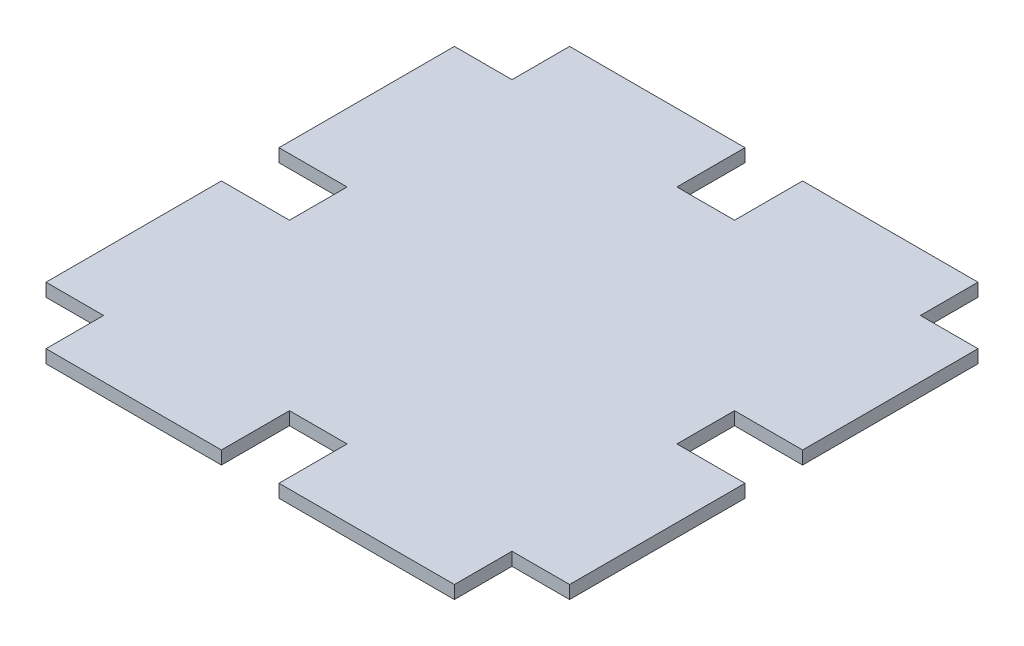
ISO-10303-21;
HEADER;
FILE_DESCRIPTION(('STEP AP214'),'2;1');
FILE_NAME('part.step','',(''),(''),'','','');
FILE_SCHEMA(('AUTOMOTIVE_DESIGN { 1 0 10303 214 1 1 1 1 }'));
ENDSEC;
DATA;
#1=APPLICATION_CONTEXT('core data for automotive mechanical design processes');
#2=APPLICATION_PROTOCOL_DEFINITION('international standard','automotive_design',2000,#1);
#3=PRODUCT_CONTEXT('',#1,'mechanical');
#4=PRODUCT('Part','Part','',(#3));
#5=PRODUCT_RELATED_PRODUCT_CATEGORY('part','',(#4));
#6=PRODUCT_DEFINITION_FORMATION('','',#4);
#7=PRODUCT_DEFINITION_CONTEXT('part definition',#1,'design');
#8=PRODUCT_DEFINITION('design','',#6,#7);
#9=PRODUCT_DEFINITION_SHAPE('','',#8);
#10=(LENGTH_UNIT() NAMED_UNIT(*) SI_UNIT(.MILLI.,.METRE.));
#11=(NAMED_UNIT(*) PLANE_ANGLE_UNIT() SI_UNIT($,.RADIAN.));
#12=(NAMED_UNIT(*) SI_UNIT($,.STERADIAN.) SOLID_ANGLE_UNIT());
#13=UNCERTAINTY_MEASURE_WITH_UNIT(LENGTH_MEASURE(1.E-05),#10,'distance_accuracy_value','');
#14=(GEOMETRIC_REPRESENTATION_CONTEXT(3) GLOBAL_UNCERTAINTY_ASSIGNED_CONTEXT((#13)) GLOBAL_UNIT_ASSIGNED_CONTEXT((#10,
#11,#12)) REPRESENTATION_CONTEXT('',''));
#15=CARTESIAN_POINT('',(0.,0.,0.));
#16=DIRECTION('',(0.,0.,1.));
#17=DIRECTION('',(1.,0.,0.));
#18=AXIS2_PLACEMENT_3D('',#15,#16,#17);
#19=CARTESIAN_POINT('',(0.,6.35,127.));
#20=DIRECTION('',(0.,0.,-1.));
#21=DIRECTION('',(-1.,0.,0.));
#22=AXIS2_PLACEMENT_3D('',#19,#20,#21);
#23=PLANE('',#22);
#24=DIRECTION('',(1.,0.,0.));
#25=VECTOR('',#24,1.);
#26=CARTESIAN_POINT('',(0.,0.,127.));
#27=LINE('',#26,#25);
#28=CARTESIAN_POINT('',(13.97,0.,127.));
#29=VERTEX_POINT('',#28);
#30=CARTESIAN_POINT('',(99.06,0.,127.));
#31=VERTEX_POINT('',#30);
#32=EDGE_CURVE('E253',#29,#31,#27,.T.);
#33=ORIENTED_EDGE('',*,*,#32,.T.);
#34=DIRECTION('',(0.,-1.,0.));
#35=VECTOR('',#34,1.);
#36=CARTESIAN_POINT('',(99.06,6.35,127.));
#37=LINE('',#36,#35);
#38=CARTESIAN_POINT('',(99.06,6.35,127.));
#39=VERTEX_POINT('',#38);
#40=EDGE_CURVE('E11',#39,#31,#37,.T.);
#41=ORIENTED_EDGE('',*,*,#40,.F.);
#42=DIRECTION('',(1.,0.,0.));
#43=VECTOR('',#42,1.);
#44=CARTESIAN_POINT('',(0.,6.35,127.));
#45=LINE('',#44,#43);
#46=CARTESIAN_POINT('',(13.97,6.35,127.));
#47=VERTEX_POINT('',#46);
#48=EDGE_CURVE('E323',#47,#39,#45,.T.);
#49=ORIENTED_EDGE('',*,*,#48,.F.);
#50=DIRECTION('',(0.,-1.,0.));
#51=VECTOR('',#50,1.);
#52=CARTESIAN_POINT('',(13.97,6.35,127.));
#53=LINE('',#52,#51);
#54=EDGE_CURVE('E51',#47,#29,#53,.T.);
#55=ORIENTED_EDGE('',*,*,#54,.T.);
#56=EDGE_LOOP('',(#33,#41,#49,#55));
#57=FACE_BOUND('',#56,.T.);
#58=ADVANCED_FACE('F34',(#57),#23,.F.);
#59=CARTESIAN_POINT('',(99.06,6.35,0.));
#60=DIRECTION('',(-1.,0.,0.));
#61=DIRECTION('',(0.,0.,1.));
#62=AXIS2_PLACEMENT_3D('',#59,#60,#61);
#63=PLANE('',#62);
#64=DIRECTION('',(0.,0.,-1.));
#65=VECTOR('',#64,1.);
#66=CARTESIAN_POINT('',(99.06,0.,0.));
#67=LINE('',#66,#65);
#68=CARTESIAN_POINT('',(99.06,0.,99.0599999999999));
#69=VERTEX_POINT('',#68);
#70=EDGE_CURVE('E255',#31,#69,#67,.T.);
#71=ORIENTED_EDGE('',*,*,#70,.T.);
#72=DIRECTION('',(0.,-1.,0.));
#73=VECTOR('',#72,1.);
#74=CARTESIAN_POINT('',(99.06,6.35,99.0599999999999));
#75=LINE('',#74,#73);
#76=CARTESIAN_POINT('',(99.06,6.35,99.0599999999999));
#77=VERTEX_POINT('',#76);
#78=EDGE_CURVE('E43',#77,#69,#75,.T.);
#79=ORIENTED_EDGE('',*,*,#78,.F.);
#80=DIRECTION('',(0.,0.,-1.));
#81=VECTOR('',#80,1.);
#82=CARTESIAN_POINT('',(99.06,6.35,0.));
#83=LINE('',#82,#81);
#84=EDGE_CURVE('E150',#39,#77,#83,.T.);
#85=ORIENTED_EDGE('',*,*,#84,.F.);
#86=ORIENTED_EDGE('',*,*,#40,.T.);
#87=EDGE_LOOP('',(#71,#79,#85,#86));
#88=FACE_BOUND('',#87,.T.);
#89=ADVANCED_FACE('F36',(#88),#63,.F.);
#90=CARTESIAN_POINT('',(0.,6.35,99.06));
#91=DIRECTION('',(0.,0.,1.));
#92=DIRECTION('',(1.,0.,0.));
#93=AXIS2_PLACEMENT_3D('',#90,#91,#92);
#94=PLANE('',#93);
#95=DIRECTION('',(-1.,0.,0.));
#96=VECTOR('',#95,1.);
#97=CARTESIAN_POINT('',(0.,0.,99.06));
#98=LINE('',#97,#96);
#99=CARTESIAN_POINT('',(127.,0.,99.0599999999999));
#100=VERTEX_POINT('',#99);
#101=EDGE_CURVE('E259',#100,#69,#98,.T.);
#102=ORIENTED_EDGE('',*,*,#101,.F.);
#103=DIRECTION('',(0.,-1.,0.));
#104=VECTOR('',#103,1.);
#105=CARTESIAN_POINT('',(127.,6.35,99.0599999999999));
#106=LINE('',#105,#104);
#107=CARTESIAN_POINT('',(127.,6.35,99.0599999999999));
#108=VERTEX_POINT('',#107);
#109=EDGE_CURVE('E372',#108,#100,#106,.T.);
#110=ORIENTED_EDGE('',*,*,#109,.F.);
#111=DIRECTION('',(-1.,0.,0.));
#112=VECTOR('',#111,1.);
#113=CARTESIAN_POINT('',(0.,6.35,99.06));
#114=LINE('',#113,#112);
#115=EDGE_CURVE('E378',#108,#77,#114,.T.);
#116=ORIENTED_EDGE('',*,*,#115,.T.);
#117=ORIENTED_EDGE('',*,*,#78,.T.);
#118=EDGE_LOOP('',(#102,#110,#116,#117));
#119=FACE_BOUND('',#118,.T.);
#120=ADVANCED_FACE('F376',(#119),#94,.T.);
#121=CARTESIAN_POINT('',(127.,6.35,0.));
#122=DIRECTION('',(1.,0.,0.));
#123=DIRECTION('',(0.,0.,-1.));
#124=AXIS2_PLACEMENT_3D('',#121,#122,#123);
#125=PLANE('',#124);
#126=DIRECTION('',(0.,0.,1.));
#127=VECTOR('',#126,1.);
#128=CARTESIAN_POINT('',(127.,0.,0.));
#129=LINE('',#128,#127);
#130=CARTESIAN_POINT('',(127.,0.,13.9699999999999));
#131=VERTEX_POINT('',#130);
#132=EDGE_CURVE('E262',#131,#100,#129,.T.);
#133=ORIENTED_EDGE('',*,*,#132,.F.);
#134=DIRECTION('',(0.,-1.,0.));
#135=VECTOR('',#134,1.);
#136=CARTESIAN_POINT('',(127.,6.35,13.9699999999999));
#137=LINE('',#136,#135);
#138=CARTESIAN_POINT('',(127.,6.35,13.9699999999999));
#139=VERTEX_POINT('',#138);
#140=EDGE_CURVE('E370',#139,#131,#137,.T.);
#141=ORIENTED_EDGE('',*,*,#140,.F.);
#142=DIRECTION('',(0.,0.,1.));
#143=VECTOR('',#142,1.);
#144=CARTESIAN_POINT('',(127.,6.35,0.));
#145=LINE('',#144,#143);
#146=EDGE_CURVE('E389',#139,#108,#145,.T.);
#147=ORIENTED_EDGE('',*,*,#146,.T.);
#148=ORIENTED_EDGE('',*,*,#109,.T.);
#149=EDGE_LOOP('',(#133,#141,#147,#148));
#150=FACE_BOUND('',#149,.T.);
#151=ADVANCED_FACE('F385',(#150),#125,.T.);
#152=CARTESIAN_POINT('',(0.,6.35,13.9699999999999));
#153=DIRECTION('',(0.,0.,1.));
#154=DIRECTION('',(1.,0.,0.));
#155=AXIS2_PLACEMENT_3D('',#152,#153,#154);
#156=PLANE('',#155);
#157=DIRECTION('',(-1.,0.,0.));
#158=VECTOR('',#157,1.);
#159=CARTESIAN_POINT('',(0.,0.,13.9699999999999));
#160=LINE('',#159,#158);
#161=CARTESIAN_POINT('',(93.98,0.,13.9699999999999));
#162=VERTEX_POINT('',#161);
#163=EDGE_CURVE('E265',#131,#162,#160,.T.);
#164=ORIENTED_EDGE('',*,*,#163,.T.);
#165=DIRECTION('',(0.,-1.,0.));
#166=VECTOR('',#165,1.);
#167=CARTESIAN_POINT('',(93.98,6.35,13.9699999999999));
#168=LINE('',#167,#166);
#169=CARTESIAN_POINT('',(93.98,6.35,13.9699999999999));
#170=VERTEX_POINT('',#169);
#171=EDGE_CURVE('E368',#170,#162,#168,.T.);
#172=ORIENTED_EDGE('',*,*,#171,.F.);
#173=DIRECTION('',(-1.,0.,0.));
#174=VECTOR('',#173,1.);
#175=CARTESIAN_POINT('',(0.,6.35,13.9699999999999));
#176=LINE('',#175,#174);
#177=EDGE_CURVE('E391',#139,#170,#176,.T.);
#178=ORIENTED_EDGE('',*,*,#177,.F.);
#179=ORIENTED_EDGE('',*,*,#140,.T.);
#180=EDGE_LOOP('',(#164,#172,#178,#179));
#181=FACE_BOUND('',#180,.T.);
#182=ADVANCED_FACE('F551',(#181),#156,.F.);
#183=CARTESIAN_POINT('',(93.98,6.35,0.));
#184=DIRECTION('',(1.,0.,0.));
#185=DIRECTION('',(0.,0.,-1.));
#186=AXIS2_PLACEMENT_3D('',#183,#184,#185);
#187=PLANE('',#186);
#188=DIRECTION('',(0.,0.,1.));
#189=VECTOR('',#188,1.);
#190=CARTESIAN_POINT('',(93.98,0.,0.));
#191=LINE('',#190,#189);
#192=CARTESIAN_POINT('',(93.98,0.,-13.9700000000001));
#193=VERTEX_POINT('',#192);
#194=EDGE_CURVE('E269',#193,#162,#191,.T.);
#195=ORIENTED_EDGE('',*,*,#194,.F.);
#196=DIRECTION('',(0.,-1.,0.));
#197=VECTOR('',#196,1.);
#198=CARTESIAN_POINT('',(93.98,6.35,-13.9700000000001));
#199=LINE('',#198,#197);
#200=CARTESIAN_POINT('',(93.98,6.35,-13.9700000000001));
#201=VERTEX_POINT('',#200);
#202=EDGE_CURVE('E366',#201,#193,#199,.T.);
#203=ORIENTED_EDGE('',*,*,#202,.F.);
#204=DIRECTION('',(0.,0.,1.));
#205=VECTOR('',#204,1.);
#206=CARTESIAN_POINT('',(93.98,6.35,0.));
#207=LINE('',#206,#205);
#208=EDGE_CURVE('E398',#201,#170,#207,.T.);
#209=ORIENTED_EDGE('',*,*,#208,.T.);
#210=ORIENTED_EDGE('',*,*,#171,.T.);
#211=EDGE_LOOP('',(#195,#203,#209,#210));
#212=FACE_BOUND('',#211,.T.);
#213=ADVANCED_FACE('F548',(#212),#187,.T.);
#214=CARTESIAN_POINT('',(0.,6.35,-13.97));
#215=DIRECTION('',(0.,0.,1.));
#216=DIRECTION('',(1.,0.,0.));
#217=AXIS2_PLACEMENT_3D('',#214,#215,#216);
#218=PLANE('',#217);
#219=DIRECTION('',(-1.,0.,0.));
#220=VECTOR('',#219,1.);
#221=CARTESIAN_POINT('',(0.,0.,-13.97));
#222=LINE('',#221,#220);
#223=CARTESIAN_POINT('',(127.,0.,-13.9700000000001));
#224=VERTEX_POINT('',#223);
#225=EDGE_CURVE('E272',#224,#193,#222,.T.);
#226=ORIENTED_EDGE('',*,*,#225,.F.);
#227=DIRECTION('',(0.,-1.,0.));
#228=VECTOR('',#227,1.);
#229=CARTESIAN_POINT('',(127.,6.35,-13.9700000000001));
#230=LINE('',#229,#228);
#231=CARTESIAN_POINT('',(127.,6.35,-13.9700000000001));
#232=VERTEX_POINT('',#231);
#233=EDGE_CURVE('E364',#232,#224,#230,.T.);
#234=ORIENTED_EDGE('',*,*,#233,.F.);
#235=DIRECTION('',(-1.,0.,0.));
#236=VECTOR('',#235,1.);
#237=CARTESIAN_POINT('',(0.,6.35,-13.97));
#238=LINE('',#237,#236);
#239=EDGE_CURVE('E401',#232,#201,#238,.T.);
#240=ORIENTED_EDGE('',*,*,#239,.T.);
#241=ORIENTED_EDGE('',*,*,#202,.T.);
#242=EDGE_LOOP('',(#226,#234,#240,#241));
#243=FACE_BOUND('',#242,.T.);
#244=ADVANCED_FACE('F544',(#243),#218,.T.);
#245=CARTESIAN_POINT('',(127.,0.,-99.06));
#246=VERTEX_POINT('',#245);
#247=EDGE_CURVE('E266',#246,#224,#129,.T.);
#248=ORIENTED_EDGE('',*,*,#247,.F.);
#249=DIRECTION('',(0.,-1.,0.));
#250=VECTOR('',#249,1.);
#251=CARTESIAN_POINT('',(127.,6.35,-99.06));
#252=LINE('',#251,#250);
#253=CARTESIAN_POINT('',(127.,6.35,-99.06));
#254=VERTEX_POINT('',#253);
#255=EDGE_CURVE('E362',#254,#246,#252,.T.);
#256=ORIENTED_EDGE('',*,*,#255,.F.);
#257=EDGE_CURVE('E393',#254,#232,#145,.T.);
#258=ORIENTED_EDGE('',*,*,#257,.T.);
#259=ORIENTED_EDGE('',*,*,#233,.T.);
#260=EDGE_LOOP('',(#248,#256,#258,#259));
#261=FACE_BOUND('',#260,.T.);
#262=ADVANCED_FACE('F540',(#261),#125,.T.);
#263=CARTESIAN_POINT('',(0.,6.35,-99.0600000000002));
#264=DIRECTION('',(0.,0.,1.));
#265=DIRECTION('',(1.,0.,0.));
#266=AXIS2_PLACEMENT_3D('',#263,#264,#265);
#267=PLANE('',#266);
#268=DIRECTION('',(-1.,0.,0.));
#269=VECTOR('',#268,1.);
#270=CARTESIAN_POINT('',(0.,0.,-99.0600000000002));
#271=LINE('',#270,#269);
#272=CARTESIAN_POINT('',(99.06,0.,-99.0600000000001));
#273=VERTEX_POINT('',#272);
#274=EDGE_CURVE('E275',#246,#273,#271,.T.);
#275=ORIENTED_EDGE('',*,*,#274,.T.);
#276=DIRECTION('',(0.,-1.,0.));
#277=VECTOR('',#276,1.);
#278=CARTESIAN_POINT('',(99.06,6.35,-99.0600000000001));
#279=LINE('',#278,#277);
#280=CARTESIAN_POINT('',(99.06,6.35,-99.0600000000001));
#281=VERTEX_POINT('',#280);
#282=EDGE_CURVE('E360',#281,#273,#279,.T.);
#283=ORIENTED_EDGE('',*,*,#282,.F.);
#284=DIRECTION('',(-1.,0.,0.));
#285=VECTOR('',#284,1.);
#286=CARTESIAN_POINT('',(0.,6.35,-99.0600000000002));
#287=LINE('',#286,#285);
#288=EDGE_CURVE('E404',#254,#281,#287,.T.);
#289=ORIENTED_EDGE('',*,*,#288,.F.);
#290=ORIENTED_EDGE('',*,*,#255,.T.);
#291=EDGE_LOOP('',(#275,#283,#289,#290));
#292=FACE_BOUND('',#291,.T.);
#293=ADVANCED_FACE('F536',(#292),#267,.F.);
#294=CARTESIAN_POINT('',(99.06,6.35,0.));
#295=DIRECTION('',(1.,0.,0.));
#296=DIRECTION('',(0.,0.,-1.));
#297=AXIS2_PLACEMENT_3D('',#294,#295,#296);
#298=PLANE('',#297);
#299=DIRECTION('',(0.,0.,1.));
#300=VECTOR('',#299,1.);
#301=CARTESIAN_POINT('',(99.06,0.,0.));
#302=LINE('',#301,#300);
#303=CARTESIAN_POINT('',(99.06,0.,-127.));
#304=VERTEX_POINT('',#303);
#305=EDGE_CURVE('E278',#304,#273,#302,.T.);
#306=ORIENTED_EDGE('',*,*,#305,.F.);
#307=DIRECTION('',(0.,-1.,0.));
#308=VECTOR('',#307,1.);
#309=CARTESIAN_POINT('',(99.06,6.35,-127.));
#310=LINE('',#309,#308);
#311=CARTESIAN_POINT('',(99.06,6.35,-127.));
#312=VERTEX_POINT('',#311);
#313=EDGE_CURVE('E358',#312,#304,#310,.T.);
#314=ORIENTED_EDGE('',*,*,#313,.F.);
#315=DIRECTION('',(0.,0.,1.));
#316=VECTOR('',#315,1.);
#317=CARTESIAN_POINT('',(99.06,6.35,0.));
#318=LINE('',#317,#316);
#319=EDGE_CURVE('E406',#312,#281,#318,.T.);
#320=ORIENTED_EDGE('',*,*,#319,.T.);
#321=ORIENTED_EDGE('',*,*,#282,.T.);
#322=EDGE_LOOP('',(#306,#314,#320,#321));
#323=FACE_BOUND('',#322,.T.);
#324=ADVANCED_FACE('F531',(#323),#298,.T.);
#325=CARTESIAN_POINT('',(0.,6.35,-127.));
#326=DIRECTION('',(0.,0.,-1.));
#327=DIRECTION('',(-1.,0.,0.));
#328=AXIS2_PLACEMENT_3D('',#325,#326,#327);
#329=PLANE('',#328);
#330=DIRECTION('',(1.,0.,0.));
#331=VECTOR('',#330,1.);
#332=CARTESIAN_POINT('',(0.,0.,-127.));
#333=LINE('',#332,#331);
#334=CARTESIAN_POINT('',(13.97,0.,-127.));
#335=VERTEX_POINT('',#334);
#336=EDGE_CURVE('E281',#335,#304,#333,.T.);
#337=ORIENTED_EDGE('',*,*,#336,.F.);
#338=DIRECTION('',(0.,-1.,0.));
#339=VECTOR('',#338,1.);
#340=CARTESIAN_POINT('',(13.97,6.35,-127.));
#341=LINE('',#340,#339);
#342=CARTESIAN_POINT('',(13.97,6.35,-127.));
#343=VERTEX_POINT('',#342);
#344=EDGE_CURVE('E356',#343,#335,#341,.T.);
#345=ORIENTED_EDGE('',*,*,#344,.F.);
#346=DIRECTION('',(1.,0.,0.));
#347=VECTOR('',#346,1.);
#348=CARTESIAN_POINT('',(0.,6.35,-127.));
#349=LINE('',#348,#347);
#350=EDGE_CURVE('E409',#343,#312,#349,.T.);
#351=ORIENTED_EDGE('',*,*,#350,.T.);
#352=ORIENTED_EDGE('',*,*,#313,.T.);
#353=EDGE_LOOP('',(#337,#345,#351,#352));
#354=FACE_BOUND('',#353,.T.);
#355=ADVANCED_FACE('F525',(#354),#329,.T.);
#356=CARTESIAN_POINT('',(13.97,6.35,0.));
#357=DIRECTION('',(1.,0.,0.));
#358=DIRECTION('',(0.,0.,-1.));
#359=AXIS2_PLACEMENT_3D('',#356,#357,#358);
#360=PLANE('',#359);
#361=DIRECTION('',(0.,0.,1.));
#362=VECTOR('',#361,1.);
#363=CARTESIAN_POINT('',(13.97,0.,0.));
#364=LINE('',#363,#362);
#365=CARTESIAN_POINT('',(13.97,0.,-93.9800000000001));
#366=VERTEX_POINT('',#365);
#367=EDGE_CURVE('E284',#335,#366,#364,.T.);
#368=ORIENTED_EDGE('',*,*,#367,.T.);
#369=DIRECTION('',(0.,-1.,0.));
#370=VECTOR('',#369,1.);
#371=CARTESIAN_POINT('',(13.97,6.35,-93.9800000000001));
#372=LINE('',#371,#370);
#373=CARTESIAN_POINT('',(13.97,6.35,-93.9800000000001));
#374=VERTEX_POINT('',#373);
#375=EDGE_CURVE('E354',#374,#366,#372,.T.);
#376=ORIENTED_EDGE('',*,*,#375,.F.);
#377=DIRECTION('',(0.,0.,1.));
#378=VECTOR('',#377,1.);
#379=CARTESIAN_POINT('',(13.97,6.35,0.));
#380=LINE('',#379,#378);
#381=EDGE_CURVE('E412',#343,#374,#380,.T.);
#382=ORIENTED_EDGE('',*,*,#381,.F.);
#383=ORIENTED_EDGE('',*,*,#344,.T.);
#384=EDGE_LOOP('',(#368,#376,#382,#383));
#385=FACE_BOUND('',#384,.T.);
#386=ADVANCED_FACE('F522',(#385),#360,.F.);
#387=CARTESIAN_POINT('',(0.,6.35,-93.9800000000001));
#388=DIRECTION('',(0.,0.,-1.));
#389=DIRECTION('',(-1.,0.,0.));
#390=AXIS2_PLACEMENT_3D('',#387,#388,#389);
#391=PLANE('',#390);
#392=DIRECTION('',(1.,0.,0.));
#393=VECTOR('',#392,1.);
#394=CARTESIAN_POINT('',(0.,0.,-93.9800000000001));
#395=LINE('',#394,#393);
#396=CARTESIAN_POINT('',(-13.97,0.,-93.9800000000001));
#397=VERTEX_POINT('',#396);
#398=EDGE_CURVE('E288',#397,#366,#395,.T.);
#399=ORIENTED_EDGE('',*,*,#398,.F.);
#400=DIRECTION('',(0.,-1.,0.));
#401=VECTOR('',#400,1.);
#402=CARTESIAN_POINT('',(-13.97,6.35,-93.9800000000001));
#403=LINE('',#402,#401);
#404=CARTESIAN_POINT('',(-13.97,6.35,-93.9800000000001));
#405=VERTEX_POINT('',#404);
#406=EDGE_CURVE('E352',#405,#397,#403,.T.);
#407=ORIENTED_EDGE('',*,*,#406,.F.);
#408=DIRECTION('',(1.,0.,0.));
#409=VECTOR('',#408,1.);
#410=CARTESIAN_POINT('',(0.,6.35,-93.9800000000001));
#411=LINE('',#410,#409);
#412=EDGE_CURVE('E415',#405,#374,#411,.T.);
#413=ORIENTED_EDGE('',*,*,#412,.T.);
#414=ORIENTED_EDGE('',*,*,#375,.T.);
#415=EDGE_LOOP('',(#399,#407,#413,#414));
#416=FACE_BOUND('',#415,.T.);
#417=ADVANCED_FACE('F517',(#416),#391,.T.);
#418=CARTESIAN_POINT('',(-13.97,6.35,0.));
#419=DIRECTION('',(1.,0.,0.));
#420=DIRECTION('',(0.,0.,-1.));
#421=AXIS2_PLACEMENT_3D('',#418,#419,#420);
#422=PLANE('',#421);
#423=DIRECTION('',(0.,0.,1.));
#424=VECTOR('',#423,1.);
#425=CARTESIAN_POINT('',(-13.97,0.,0.));
#426=LINE('',#425,#424);
#427=CARTESIAN_POINT('',(-13.97,0.,-127.));
#428=VERTEX_POINT('',#427);
#429=EDGE_CURVE('E291',#428,#397,#426,.T.);
#430=ORIENTED_EDGE('',*,*,#429,.F.);
#431=DIRECTION('',(0.,-1.,0.));
#432=VECTOR('',#431,1.);
#433=CARTESIAN_POINT('',(-13.97,6.35,-127.));
#434=LINE('',#433,#432);
#435=CARTESIAN_POINT('',(-13.97,6.35,-127.));
#436=VERTEX_POINT('',#435);
#437=EDGE_CURVE('E350',#436,#428,#434,.T.);
#438=ORIENTED_EDGE('',*,*,#437,.F.);
#439=DIRECTION('',(0.,0.,1.));
#440=VECTOR('',#439,1.);
#441=CARTESIAN_POINT('',(-13.97,6.35,0.));
#442=LINE('',#441,#440);
#443=EDGE_CURVE('E418',#436,#405,#442,.T.);
#444=ORIENTED_EDGE('',*,*,#443,.T.);
#445=ORIENTED_EDGE('',*,*,#406,.T.);
#446=EDGE_LOOP('',(#430,#438,#444,#445));
#447=FACE_BOUND('',#446,.T.);
#448=ADVANCED_FACE('F512',(#447),#422,.T.);
#449=CARTESIAN_POINT('',(-99.06,0.,-127.));
#450=VERTEX_POINT('',#449);
#451=EDGE_CURVE('E285',#450,#428,#333,.T.);
#452=ORIENTED_EDGE('',*,*,#451,.F.);
#453=DIRECTION('',(0.,-1.,0.));
#454=VECTOR('',#453,1.);
#455=CARTESIAN_POINT('',(-99.06,6.35,-127.));
#456=LINE('',#455,#454);
#457=CARTESIAN_POINT('',(-99.06,6.35,-127.));
#458=VERTEX_POINT('',#457);
#459=EDGE_CURVE('E348',#458,#450,#456,.T.);
#460=ORIENTED_EDGE('',*,*,#459,.F.);
#461=EDGE_CURVE('E413',#458,#436,#349,.T.);
#462=ORIENTED_EDGE('',*,*,#461,.T.);
#463=ORIENTED_EDGE('',*,*,#437,.T.);
#464=EDGE_LOOP('',(#452,#460,#462,#463));
#465=FACE_BOUND('',#464,.T.);
#466=ADVANCED_FACE('F505',(#465),#329,.T.);
#467=CARTESIAN_POINT('',(-99.06,6.35,0.));
#468=DIRECTION('',(1.,0.,0.));
#469=DIRECTION('',(0.,0.,-1.));
#470=AXIS2_PLACEMENT_3D('',#467,#468,#469);
#471=PLANE('',#470);
#472=DIRECTION('',(0.,0.,1.));
#473=VECTOR('',#472,1.);
#474=CARTESIAN_POINT('',(-99.06,0.,0.));
#475=LINE('',#474,#473);
#476=CARTESIAN_POINT('',(-99.06,0.,-99.06));
#477=VERTEX_POINT('',#476);
#478=EDGE_CURVE('E294',#450,#477,#475,.T.);
#479=ORIENTED_EDGE('',*,*,#478,.T.);
#480=DIRECTION('',(0.,-1.,0.));
#481=VECTOR('',#480,1.);
#482=CARTESIAN_POINT('',(-99.06,6.35,-99.06));
#483=LINE('',#482,#481);
#484=CARTESIAN_POINT('',(-99.06,6.35,-99.06));
#485=VERTEX_POINT('',#484);
#486=EDGE_CURVE('E346',#485,#477,#483,.T.);
#487=ORIENTED_EDGE('',*,*,#486,.F.);
#488=DIRECTION('',(0.,0.,1.));
#489=VECTOR('',#488,1.);
#490=CARTESIAN_POINT('',(-99.06,6.35,0.));
#491=LINE('',#490,#489);
#492=EDGE_CURVE('E421',#458,#485,#491,.T.);
#493=ORIENTED_EDGE('',*,*,#492,.F.);
#494=ORIENTED_EDGE('',*,*,#459,.T.);
#495=EDGE_LOOP('',(#479,#487,#493,#494));
#496=FACE_BOUND('',#495,.T.);
#497=ADVANCED_FACE('F552',(#496),#471,.F.);
#498=CARTESIAN_POINT('',(0.,6.35,-99.06));
#499=DIRECTION('',(0.,0.,-1.));
#500=DIRECTION('',(-1.,0.,0.));
#501=AXIS2_PLACEMENT_3D('',#498,#499,#500);
#502=PLANE('',#501);
#503=DIRECTION('',(1.,0.,0.));
#504=VECTOR('',#503,1.);
#505=CARTESIAN_POINT('',(0.,0.,-99.06));
#506=LINE('',#505,#504);
#507=CARTESIAN_POINT('',(-127.,0.,-99.06));
#508=VERTEX_POINT('',#507);
#509=EDGE_CURVE('E297',#508,#477,#506,.T.);
#510=ORIENTED_EDGE('',*,*,#509,.F.);
#511=DIRECTION('',(0.,-1.,0.));
#512=VECTOR('',#511,1.);
#513=CARTESIAN_POINT('',(-127.,6.35,-99.06));
#514=LINE('',#513,#512);
#515=CARTESIAN_POINT('',(-127.,6.35,-99.06));
#516=VERTEX_POINT('',#515);
#517=EDGE_CURVE('E344',#516,#508,#514,.T.);
#518=ORIENTED_EDGE('',*,*,#517,.F.);
#519=DIRECTION('',(1.,0.,0.));
#520=VECTOR('',#519,1.);
#521=CARTESIAN_POINT('',(0.,6.35,-99.06));
#522=LINE('',#521,#520);
#523=EDGE_CURVE('E423',#516,#485,#522,.T.);
#524=ORIENTED_EDGE('',*,*,#523,.T.);
#525=ORIENTED_EDGE('',*,*,#486,.T.);
#526=EDGE_LOOP('',(#510,#518,#524,#525));
#527=FACE_BOUND('',#526,.T.);
#528=ADVANCED_FACE('F498',(#527),#502,.T.);
#529=CARTESIAN_POINT('',(-127.,6.35,0.));
#530=DIRECTION('',(1.,0.,0.));
#531=DIRECTION('',(0.,0.,-1.));
#532=AXIS2_PLACEMENT_3D('',#529,#530,#531);
#533=PLANE('',#532);
#534=DIRECTION('',(0.,0.,1.));
#535=VECTOR('',#534,1.);
#536=CARTESIAN_POINT('',(-127.,0.,0.));
#537=LINE('',#536,#535);
#538=CARTESIAN_POINT('',(-127.,0.,-13.9700000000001));
#539=VERTEX_POINT('',#538);
#540=EDGE_CURVE('E300',#508,#539,#537,.T.);
#541=ORIENTED_EDGE('',*,*,#540,.T.);
#542=DIRECTION('',(0.,-1.,0.));
#543=VECTOR('',#542,1.);
#544=CARTESIAN_POINT('',(-127.,6.35,-13.9700000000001));
#545=LINE('',#544,#543);
#546=CARTESIAN_POINT('',(-127.,6.35,-13.9700000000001));
#547=VERTEX_POINT('',#546);
#548=EDGE_CURVE('E341',#547,#539,#545,.T.);
#549=ORIENTED_EDGE('',*,*,#548,.F.);
#550=DIRECTION('',(0.,0.,1.));
#551=VECTOR('',#550,1.);
#552=CARTESIAN_POINT('',(-127.,6.35,0.));
#553=LINE('',#552,#551);
#554=EDGE_CURVE('E426',#516,#547,#553,.T.);
#555=ORIENTED_EDGE('',*,*,#554,.F.);
#556=ORIENTED_EDGE('',*,*,#517,.T.);
#557=EDGE_LOOP('',(#541,#549,#555,#556));
#558=FACE_BOUND('',#557,.T.);
#559=ADVANCED_FACE('F495',(#558),#533,.F.);
#560=CARTESIAN_POINT('',(0.,6.35,-13.9700000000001));
#561=DIRECTION('',(0.,0.,-1.));
#562=DIRECTION('',(-1.,0.,0.));
#563=AXIS2_PLACEMENT_3D('',#560,#561,#562);
#564=PLANE('',#563);
#565=DIRECTION('',(1.,0.,0.));
#566=VECTOR('',#565,1.);
#567=CARTESIAN_POINT('',(0.,0.,-13.9700000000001));
#568=LINE('',#567,#566);
#569=CARTESIAN_POINT('',(-93.98,0.,-13.9700000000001));
#570=VERTEX_POINT('',#569);
#571=EDGE_CURVE('E302',#539,#570,#568,.T.);
#572=ORIENTED_EDGE('',*,*,#571,.T.);
#573=DIRECTION('',(0.,-1.,0.));
#574=VECTOR('',#573,1.);
#575=CARTESIAN_POINT('',(-93.98,6.35,-13.9700000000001));
#576=LINE('',#575,#574);
#577=CARTESIAN_POINT('',(-93.98,6.35,-13.9700000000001));
#578=VERTEX_POINT('',#577);
#579=EDGE_CURVE('E338',#578,#570,#576,.T.);
#580=ORIENTED_EDGE('',*,*,#579,.F.);
#581=DIRECTION('',(1.,0.,0.));
#582=VECTOR('',#581,1.);
#583=CARTESIAN_POINT('',(0.,6.35,-13.9700000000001));
#584=LINE('',#583,#582);
#585=EDGE_CURVE('E428',#547,#578,#584,.T.);
#586=ORIENTED_EDGE('',*,*,#585,.F.);
#587=ORIENTED_EDGE('',*,*,#548,.T.);
#588=EDGE_LOOP('',(#572,#580,#586,#587));
#589=FACE_BOUND('',#588,.T.);
#590=ADVANCED_FACE('F490',(#589),#564,.F.);
#591=CARTESIAN_POINT('',(-93.98,6.35,0.));
#592=DIRECTION('',(1.,0.,0.));
#593=DIRECTION('',(0.,0.,-1.));
#594=AXIS2_PLACEMENT_3D('',#591,#592,#593);
#595=PLANE('',#594);
#596=DIRECTION('',(0.,0.,1.));
#597=VECTOR('',#596,1.);
#598=CARTESIAN_POINT('',(-93.98,0.,0.));
#599=LINE('',#598,#597);
#600=CARTESIAN_POINT('',(-93.98,0.,13.97));
#601=VERTEX_POINT('',#600);
#602=EDGE_CURVE('E305',#570,#601,#599,.T.);
#603=ORIENTED_EDGE('',*,*,#602,.T.);
#604=DIRECTION('',(0.,-1.,0.));
#605=VECTOR('',#604,1.);
#606=CARTESIAN_POINT('',(-93.98,6.35,13.97));
#607=LINE('',#606,#605);
#608=CARTESIAN_POINT('',(-93.98,6.35,13.97));
#609=VERTEX_POINT('',#608);
#610=EDGE_CURVE('E336',#609,#601,#607,.T.);
#611=ORIENTED_EDGE('',*,*,#610,.F.);
#612=DIRECTION('',(0.,0.,1.));
#613=VECTOR('',#612,1.);
#614=CARTESIAN_POINT('',(-93.98,6.35,0.));
#615=LINE('',#614,#613);
#616=EDGE_CURVE('E431',#578,#609,#615,.T.);
#617=ORIENTED_EDGE('',*,*,#616,.F.);
#618=ORIENTED_EDGE('',*,*,#579,.T.);
#619=EDGE_LOOP('',(#603,#611,#617,#618));
#620=FACE_BOUND('',#619,.T.);
#621=ADVANCED_FACE('F484',(#620),#595,.F.);
#622=CARTESIAN_POINT('',(0.,6.35,13.97));
#623=DIRECTION('',(0.,0.,-1.));
#624=DIRECTION('',(-1.,0.,0.));
#625=AXIS2_PLACEMENT_3D('',#622,#623,#624);
#626=PLANE('',#625);
#627=DIRECTION('',(1.,0.,0.));
#628=VECTOR('',#627,1.);
#629=CARTESIAN_POINT('',(0.,0.,13.97));
#630=LINE('',#629,#628);
#631=CARTESIAN_POINT('',(-127.,0.,13.97));
#632=VERTEX_POINT('',#631);
#633=EDGE_CURVE('E308',#632,#601,#630,.T.);
#634=ORIENTED_EDGE('',*,*,#633,.F.);
#635=DIRECTION('',(0.,-1.,0.));
#636=VECTOR('',#635,1.);
#637=CARTESIAN_POINT('',(-127.,6.35,13.97));
#638=LINE('',#637,#636);
#639=CARTESIAN_POINT('',(-127.,6.35,13.97));
#640=VERTEX_POINT('',#639);
#641=EDGE_CURVE('E334',#640,#632,#638,.T.);
#642=ORIENTED_EDGE('',*,*,#641,.F.);
#643=DIRECTION('',(1.,0.,0.));
#644=VECTOR('',#643,1.);
#645=CARTESIAN_POINT('',(0.,6.35,13.97));
#646=LINE('',#645,#644);
#647=EDGE_CURVE('E433',#640,#609,#646,.T.);
#648=ORIENTED_EDGE('',*,*,#647,.T.);
#649=ORIENTED_EDGE('',*,*,#610,.T.);
#650=EDGE_LOOP('',(#634,#642,#648,#649));
#651=FACE_BOUND('',#650,.T.);
#652=ADVANCED_FACE('F478',(#651),#626,.T.);
#653=CARTESIAN_POINT('',(-127.,0.,99.06));
#654=VERTEX_POINT('',#653);
#655=EDGE_CURVE('E303',#632,#654,#537,.T.);
#656=ORIENTED_EDGE('',*,*,#655,.T.);
#657=DIRECTION('',(0.,-1.,0.));
#658=VECTOR('',#657,1.);
#659=CARTESIAN_POINT('',(-127.,6.35,99.06));
#660=LINE('',#659,#658);
#661=CARTESIAN_POINT('',(-127.,6.35,99.06));
#662=VERTEX_POINT('',#661);
#663=EDGE_CURVE('E331',#662,#654,#660,.T.);
#664=ORIENTED_EDGE('',*,*,#663,.F.);
#665=EDGE_CURVE('E429',#640,#662,#553,.T.);
#666=ORIENTED_EDGE('',*,*,#665,.F.);
#667=ORIENTED_EDGE('',*,*,#641,.T.);
#668=EDGE_LOOP('',(#656,#664,#666,#667));
#669=FACE_BOUND('',#668,.T.);
#670=ADVANCED_FACE('F651',(#669),#533,.F.);
#671=CARTESIAN_POINT('',(0.,6.35,99.0600000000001));
#672=DIRECTION('',(0.,0.,-1.));
#673=DIRECTION('',(-1.,0.,0.));
#674=AXIS2_PLACEMENT_3D('',#671,#672,#673);
#675=PLANE('',#674);
#676=DIRECTION('',(1.,0.,0.));
#677=VECTOR('',#676,1.);
#678=CARTESIAN_POINT('',(0.,0.,99.0600000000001));
#679=LINE('',#678,#677);
#680=CARTESIAN_POINT('',(-99.06,0.,99.06));
#681=VERTEX_POINT('',#680);
#682=EDGE_CURVE('E311',#654,#681,#679,.T.);
#683=ORIENTED_EDGE('',*,*,#682,.T.);
#684=DIRECTION('',(0.,-1.,0.));
#685=VECTOR('',#684,1.);
#686=CARTESIAN_POINT('',(-99.06,6.35,99.06));
#687=LINE('',#686,#685);
#688=CARTESIAN_POINT('',(-99.06,6.35,99.06));
#689=VERTEX_POINT('',#688);
#690=EDGE_CURVE('E329',#689,#681,#687,.T.);
#691=ORIENTED_EDGE('',*,*,#690,.F.);
#692=DIRECTION('',(1.,0.,0.));
#693=VECTOR('',#692,1.);
#694=CARTESIAN_POINT('',(0.,6.35,99.0600000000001));
#695=LINE('',#694,#693);
#696=EDGE_CURVE('E436',#662,#689,#695,.T.);
#697=ORIENTED_EDGE('',*,*,#696,.F.);
#698=ORIENTED_EDGE('',*,*,#663,.T.);
#699=EDGE_LOOP('',(#683,#691,#697,#698));
#700=FACE_BOUND('',#699,.T.);
#701=ADVANCED_FACE('F465',(#700),#675,.F.);
#702=CARTESIAN_POINT('',(-99.0599999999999,6.35,0.));
#703=DIRECTION('',(-1.,0.,0.));
#704=DIRECTION('',(0.,0.,1.));
#705=AXIS2_PLACEMENT_3D('',#702,#703,#704);
#706=PLANE('',#705);
#707=DIRECTION('',(0.,0.,-1.));
#708=VECTOR('',#707,1.);
#709=CARTESIAN_POINT('',(-99.0599999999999,0.,0.));
#710=LINE('',#709,#708);
#711=CARTESIAN_POINT('',(-99.06,0.,127.));
#712=VERTEX_POINT('',#711);
#713=EDGE_CURVE('E314',#712,#681,#710,.T.);
#714=ORIENTED_EDGE('',*,*,#713,.F.);
#715=DIRECTION('',(0.,-1.,0.));
#716=VECTOR('',#715,1.);
#717=CARTESIAN_POINT('',(-99.06,6.35,127.));
#718=LINE('',#717,#716);
#719=CARTESIAN_POINT('',(-99.06,6.35,127.));
#720=VERTEX_POINT('',#719);
#721=EDGE_CURVE('E327',#720,#712,#718,.T.);
#722=ORIENTED_EDGE('',*,*,#721,.F.);
#723=DIRECTION('',(0.,0.,-1.));
#724=VECTOR('',#723,1.);
#725=CARTESIAN_POINT('',(-99.0599999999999,6.35,0.));
#726=LINE('',#725,#724);
#727=EDGE_CURVE('E437',#720,#689,#726,.T.);
#728=ORIENTED_EDGE('',*,*,#727,.T.);
#729=ORIENTED_EDGE('',*,*,#690,.T.);
#730=EDGE_LOOP('',(#714,#722,#728,#729));
#731=FACE_BOUND('',#730,.T.);
#732=ADVANCED_FACE('F459',(#731),#706,.T.);
#733=CARTESIAN_POINT('',(-13.97,0.,127.));
#734=VERTEX_POINT('',#733);
#735=EDGE_CURVE('E256',#712,#734,#27,.T.);
#736=ORIENTED_EDGE('',*,*,#735,.T.);
#737=DIRECTION('',(0.,-1.,0.));
#738=VECTOR('',#737,1.);
#739=CARTESIAN_POINT('',(-13.97,6.35,127.));
#740=LINE('',#739,#738);
#741=CARTESIAN_POINT('',(-13.97,6.35,127.));
#742=VERTEX_POINT('',#741);
#743=EDGE_CURVE('E245',#742,#734,#740,.T.);
#744=ORIENTED_EDGE('',*,*,#743,.F.);
#745=EDGE_CURVE('E233',#720,#742,#45,.T.);
#746=ORIENTED_EDGE('',*,*,#745,.F.);
#747=ORIENTED_EDGE('',*,*,#721,.T.);
#748=EDGE_LOOP('',(#736,#744,#746,#747));
#749=FACE_BOUND('',#748,.T.);
#750=ADVANCED_FACE('F452',(#749),#23,.F.);
#751=CARTESIAN_POINT('',(-13.97,6.35,0.));
#752=DIRECTION('',(-1.,0.,0.));
#753=DIRECTION('',(0.,0.,1.));
#754=AXIS2_PLACEMENT_3D('',#751,#752,#753);
#755=PLANE('',#754);
#756=DIRECTION('',(0.,0.,-1.));
#757=VECTOR('',#756,1.);
#758=CARTESIAN_POINT('',(-13.97,0.,0.));
#759=LINE('',#758,#757);
#760=CARTESIAN_POINT('',(-13.97,0.,93.9799999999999));
#761=VERTEX_POINT('',#760);
#762=EDGE_CURVE('E242',#734,#761,#759,.T.);
#763=ORIENTED_EDGE('',*,*,#762,.T.);
#764=DIRECTION('',(0.,-1.,0.));
#765=VECTOR('',#764,1.);
#766=CARTESIAN_POINT('',(-13.97,6.35,93.9799999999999));
#767=LINE('',#766,#765);
#768=CARTESIAN_POINT('',(-13.97,6.35,93.9799999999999));
#769=VERTEX_POINT('',#768);
#770=EDGE_CURVE('E239',#769,#761,#767,.T.);
#771=ORIENTED_EDGE('',*,*,#770,.F.);
#772=DIRECTION('',(0.,0.,-1.));
#773=VECTOR('',#772,1.);
#774=CARTESIAN_POINT('',(-13.97,6.35,0.));
#775=LINE('',#774,#773);
#776=EDGE_CURVE('E225',#742,#769,#775,.T.);
#777=ORIENTED_EDGE('',*,*,#776,.F.);
#778=ORIENTED_EDGE('',*,*,#743,.T.);
#779=EDGE_LOOP('',(#763,#771,#777,#778));
#780=FACE_BOUND('',#779,.T.);
#781=ADVANCED_FACE('F240',(#780),#755,.F.);
#782=CARTESIAN_POINT('',(0.,6.35,93.9799999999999));
#783=DIRECTION('',(0.,0.,-1.));
#784=DIRECTION('',(-1.,0.,0.));
#785=AXIS2_PLACEMENT_3D('',#782,#783,#784);
#786=PLANE('',#785);
#787=DIRECTION('',(1.,0.,0.));
#788=VECTOR('',#787,1.);
#789=CARTESIAN_POINT('',(0.,0.,93.9799999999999));
#790=LINE('',#789,#788);
#791=CARTESIAN_POINT('',(13.97,0.,93.9799999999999));
#792=VERTEX_POINT('',#791);
#793=EDGE_CURVE('E318',#761,#792,#790,.T.);
#794=ORIENTED_EDGE('',*,*,#793,.T.);
#795=DIRECTION('',(0.,-1.,0.));
#796=VECTOR('',#795,1.);
#797=CARTESIAN_POINT('',(13.97,6.35,93.9799999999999));
#798=LINE('',#797,#796);
#799=CARTESIAN_POINT('',(13.97,6.35,93.9799999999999));
#800=VERTEX_POINT('',#799);
#801=EDGE_CURVE('E138',#800,#792,#798,.T.);
#802=ORIENTED_EDGE('',*,*,#801,.F.);
#803=DIRECTION('',(1.,0.,0.));
#804=VECTOR('',#803,1.);
#805=CARTESIAN_POINT('',(0.,6.35,93.9799999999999));
#806=LINE('',#805,#804);
#807=EDGE_CURVE('E230',#769,#800,#806,.T.);
#808=ORIENTED_EDGE('',*,*,#807,.F.);
#809=ORIENTED_EDGE('',*,*,#770,.T.);
#810=EDGE_LOOP('',(#794,#802,#808,#809));
#811=FACE_BOUND('',#810,.T.);
#812=ADVANCED_FACE('F247',(#811),#786,.F.);
#813=CARTESIAN_POINT('',(13.97,6.35,0.));
#814=DIRECTION('',(-1.,0.,0.));
#815=DIRECTION('',(0.,0.,1.));
#816=AXIS2_PLACEMENT_3D('',#813,#814,#815);
#817=PLANE('',#816);
#818=DIRECTION('',(0.,0.,-1.));
#819=VECTOR('',#818,1.);
#820=CARTESIAN_POINT('',(13.97,0.,0.));
#821=LINE('',#820,#819);
#822=EDGE_CURVE('E320',#29,#792,#821,.T.);
#823=ORIENTED_EDGE('',*,*,#822,.F.);
#824=ORIENTED_EDGE('',*,*,#54,.F.);
#825=DIRECTION('',(0.,0.,-1.));
#826=VECTOR('',#825,1.);
#827=CARTESIAN_POINT('',(13.97,6.35,0.));
#828=LINE('',#827,#826);
#829=EDGE_CURVE('E248',#47,#800,#828,.T.);
#830=ORIENTED_EDGE('',*,*,#829,.T.);
#831=ORIENTED_EDGE('',*,*,#801,.T.);
#832=EDGE_LOOP('',(#823,#824,#830,#831));
#833=FACE_BOUND('',#832,.T.);
#834=ADVANCED_FACE('F440',(#833),#817,.T.);
#835=CARTESIAN_POINT('',(0.,6.35,0.));
#836=DIRECTION('',(0.,1.,0.));
#837=DIRECTION('',(0.,0.,1.));
#838=AXIS2_PLACEMENT_3D('',#835,#836,#837);
#839=PLANE('',#838);
#840=ORIENTED_EDGE('',*,*,#48,.T.);
#841=ORIENTED_EDGE('',*,*,#84,.T.);
#842=ORIENTED_EDGE('',*,*,#115,.F.);
#843=ORIENTED_EDGE('',*,*,#146,.F.);
#844=ORIENTED_EDGE('',*,*,#177,.T.);
#845=ORIENTED_EDGE('',*,*,#208,.F.);
#846=ORIENTED_EDGE('',*,*,#239,.F.);
#847=ORIENTED_EDGE('',*,*,#257,.F.);
#848=ORIENTED_EDGE('',*,*,#288,.T.);
#849=ORIENTED_EDGE('',*,*,#319,.F.);
#850=ORIENTED_EDGE('',*,*,#350,.F.);
#851=ORIENTED_EDGE('',*,*,#381,.T.);
#852=ORIENTED_EDGE('',*,*,#412,.F.);
#853=ORIENTED_EDGE('',*,*,#443,.F.);
#854=ORIENTED_EDGE('',*,*,#461,.F.);
#855=ORIENTED_EDGE('',*,*,#492,.T.);
#856=ORIENTED_EDGE('',*,*,#523,.F.);
#857=ORIENTED_EDGE('',*,*,#554,.T.);
#858=ORIENTED_EDGE('',*,*,#585,.T.);
#859=ORIENTED_EDGE('',*,*,#616,.T.);
#860=ORIENTED_EDGE('',*,*,#647,.F.);
#861=ORIENTED_EDGE('',*,*,#665,.T.);
#862=ORIENTED_EDGE('',*,*,#696,.T.);
#863=ORIENTED_EDGE('',*,*,#727,.F.);
#864=ORIENTED_EDGE('',*,*,#745,.T.);
#865=ORIENTED_EDGE('',*,*,#776,.T.);
#866=ORIENTED_EDGE('',*,*,#807,.T.);
#867=ORIENTED_EDGE('',*,*,#829,.F.);
#868=EDGE_LOOP('',(#840,#841,#842,#843,#844,#845,#846,#847,#848,#849,#850,#851,#852,#853,#854,
#855,#856,#857,#858,#859,#860,#861,#862,#863,#864,#865,#866,#867));
#869=FACE_BOUND('',#868,.T.);
#870=ADVANCED_FACE('F227',(#869),#839,.T.);
#871=CARTESIAN_POINT('',(0.,0.,0.));
#872=DIRECTION('',(0.,1.,0.));
#873=DIRECTION('',(0.,0.,1.));
#874=AXIS2_PLACEMENT_3D('',#871,#872,#873);
#875=PLANE('',#874);
#876=ORIENTED_EDGE('',*,*,#32,.F.);
#877=ORIENTED_EDGE('',*,*,#822,.T.);
#878=ORIENTED_EDGE('',*,*,#793,.F.);
#879=ORIENTED_EDGE('',*,*,#762,.F.);
#880=ORIENTED_EDGE('',*,*,#735,.F.);
#881=ORIENTED_EDGE('',*,*,#713,.T.);
#882=ORIENTED_EDGE('',*,*,#682,.F.);
#883=ORIENTED_EDGE('',*,*,#655,.F.);
#884=ORIENTED_EDGE('',*,*,#633,.T.);
#885=ORIENTED_EDGE('',*,*,#602,.F.);
#886=ORIENTED_EDGE('',*,*,#571,.F.);
#887=ORIENTED_EDGE('',*,*,#540,.F.);
#888=ORIENTED_EDGE('',*,*,#509,.T.);
#889=ORIENTED_EDGE('',*,*,#478,.F.);
#890=ORIENTED_EDGE('',*,*,#451,.T.);
#891=ORIENTED_EDGE('',*,*,#429,.T.);
#892=ORIENTED_EDGE('',*,*,#398,.T.);
#893=ORIENTED_EDGE('',*,*,#367,.F.);
#894=ORIENTED_EDGE('',*,*,#336,.T.);
#895=ORIENTED_EDGE('',*,*,#305,.T.);
#896=ORIENTED_EDGE('',*,*,#274,.F.);
#897=ORIENTED_EDGE('',*,*,#247,.T.);
#898=ORIENTED_EDGE('',*,*,#225,.T.);
#899=ORIENTED_EDGE('',*,*,#194,.T.);
#900=ORIENTED_EDGE('',*,*,#163,.F.);
#901=ORIENTED_EDGE('',*,*,#132,.T.);
#902=ORIENTED_EDGE('',*,*,#101,.T.);
#903=ORIENTED_EDGE('',*,*,#70,.F.);
#904=EDGE_LOOP('',(#876,#877,#878,#879,#880,#881,#882,#883,#884,#885,#886,#887,#888,#889,#890,
#891,#892,#893,#894,#895,#896,#897,#898,#899,#900,#901,#902,#903));
#905=FACE_BOUND('',#904,.T.);
#906=ADVANCED_FACE('F381',(#905),#875,.F.);
#907=CLOSED_SHELL('',(#58,#89,#120,#151,#182,#213,#244,#262,#293,#324,#355,#386,#417,#448,#466,
#497,#528,#559,#590,#621,#652,#670,#701,#732,#750,#781,#812,#834,#870,#906));
#908=MANIFOLD_SOLID_BREP('B2',#907);
#909=ADVANCED_BREP_SHAPE_REPRESENTATION('',(#18,#908),#14);
#910=SHAPE_DEFINITION_REPRESENTATION(#9,#909);
ENDSEC;
END-ISO-10303-21;
